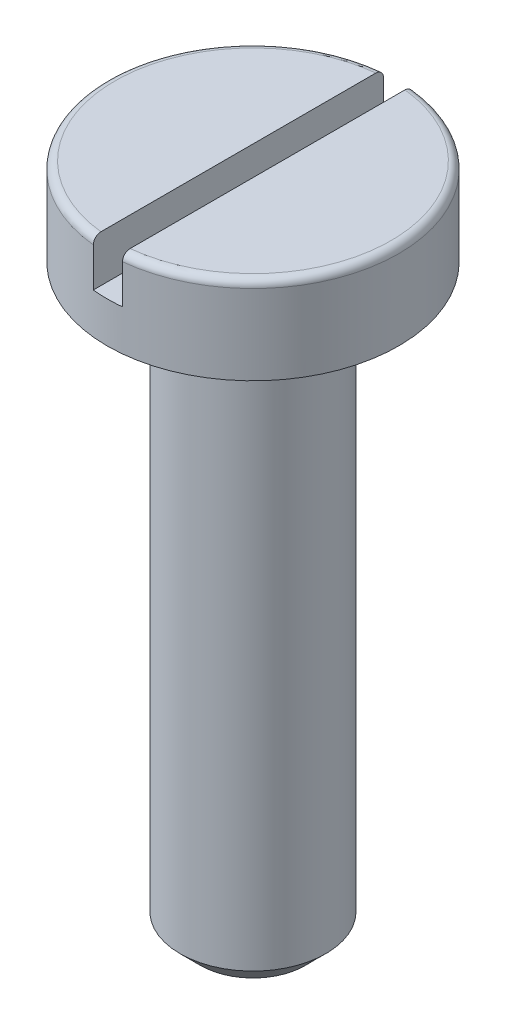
from build123d import *

# Parameters (mm, degrees)
ESQUISSE1_R             = 1.25
BASE_EXTRUSION_DEPTH    = 10
CHANFREIN1_SIZE         = 0.35
ESQUISSE3_W             = 0.5
ESQUISSE3_H             = 5
ENL_V_MAT_EXTRU_1_DEPTH = 0.8


with BuildPart() as part:
    # Esquisse1 → Base-Extrusion (new body)
    with BuildSketch(Plane(origin=(0, 0, 0), x_dir=(1, 0, 0), z_dir=(0, 1, 0))):
        with Locations(Location((0, 0, 0), (0, 0, 270))):
            Circle(ESQUISSE1_R)
    extrude(amount=-BASE_EXTRUSION_DEPTH)

    # Chanfrein1
    chanfrein1_edges = [part.edges().sort_by_distance(p)[0] for p in [
        (0, -10, -1.25),
    ]]
    chamfer(chanfrein1_edges, length=CHANFREIN1_SIZE)

    # Esquisse2 → Boss.-R_vol.1 (revolve)
    with BuildSketch(Plane.XY, mode=Mode.PRIVATE) as boss_r_vol_1_sk:
        with BuildLine():
            Line((0, 1.5), (0, 0))
            Line((0, 0), (2.5, 0))
            Line((2.5, 0), (2.5, 1.37))
            ThreePointArc((2.5, 1.37), (2.461923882, 1.461923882), (2.37, 1.5))
            Line((2.37, 1.5), (0, 1.5))
        make_face()
    revolve(boss_r_vol_1_sk.sketch.rotate(Axis((0, 1.3, 0), (0, -1, 0)), 90), axis=Axis((0, 1.3, 0), (0, -1, 0)))

    # Esquisse3 → Enl_v. mat.-Extru.1 (cut)
    with BuildSketch(Plane(origin=(0, 1.5, 0), x_dir=(-1, 0, 0), z_dir=(0, 1, 0))):
        Rectangle(ESQUISSE3_W, ESQUISSE3_H)
    extrude(amount=-ENL_V_MAT_EXTRU_1_DEPTH, mode=Mode.SUBTRACT)


solid = part.part
